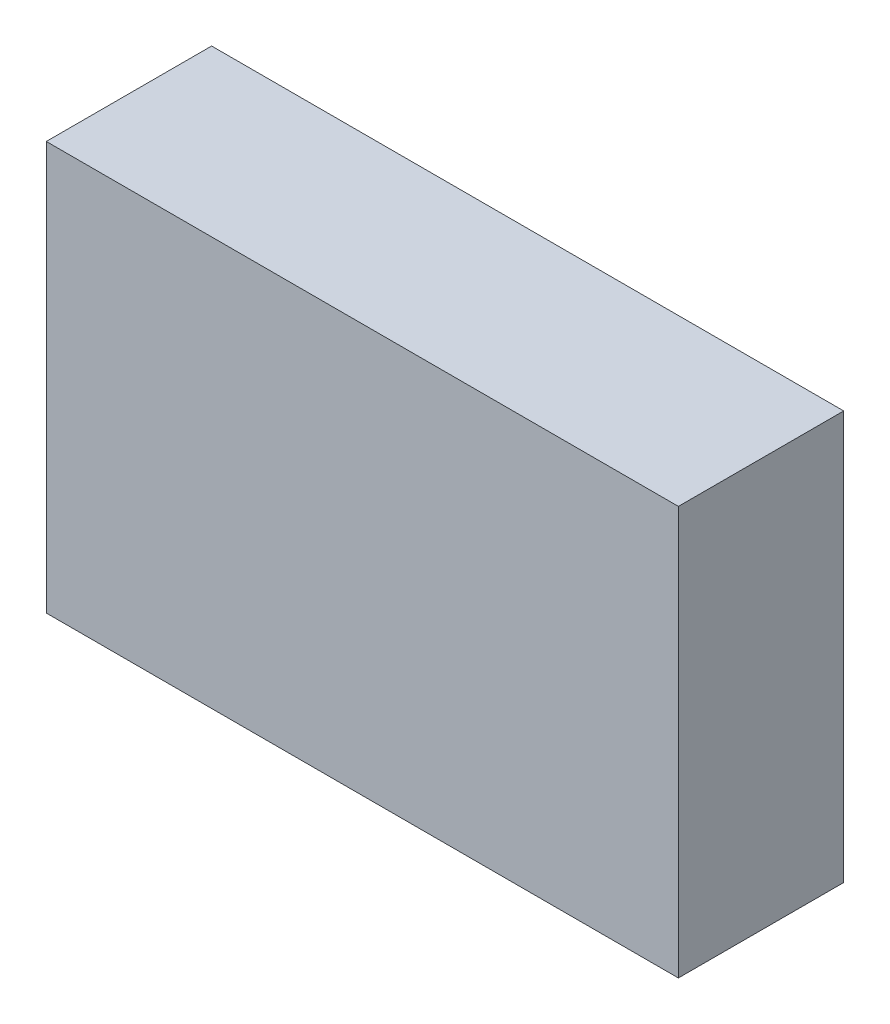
ISO-10303-21;
HEADER;
FILE_DESCRIPTION(('STEP AP214'),'2;1');
FILE_NAME('part.step','',(''),(''),'','','');
FILE_SCHEMA(('AUTOMOTIVE_DESIGN { 1 0 10303 214 1 1 1 1 }'));
ENDSEC;
DATA;
#1=APPLICATION_CONTEXT('core data for automotive mechanical design processes');
#2=APPLICATION_PROTOCOL_DEFINITION('international standard','automotive_design',2000,#1);
#3=PRODUCT_CONTEXT('',#1,'mechanical');
#4=PRODUCT('Part','Part','',(#3));
#5=PRODUCT_RELATED_PRODUCT_CATEGORY('part','',(#4));
#6=PRODUCT_DEFINITION_FORMATION('','',#4);
#7=PRODUCT_DEFINITION_CONTEXT('part definition',#1,'design');
#8=PRODUCT_DEFINITION('design','',#6,#7);
#9=PRODUCT_DEFINITION_SHAPE('','',#8);
#10=(LENGTH_UNIT() NAMED_UNIT(*) SI_UNIT(.MILLI.,.METRE.));
#11=(NAMED_UNIT(*) PLANE_ANGLE_UNIT() SI_UNIT($,.RADIAN.));
#12=(NAMED_UNIT(*) SI_UNIT($,.STERADIAN.) SOLID_ANGLE_UNIT());
#13=UNCERTAINTY_MEASURE_WITH_UNIT(LENGTH_MEASURE(1.E-05),#10,'distance_accuracy_value','');
#14=(GEOMETRIC_REPRESENTATION_CONTEXT(3) GLOBAL_UNCERTAINTY_ASSIGNED_CONTEXT((#13)) GLOBAL_UNIT_ASSIGNED_CONTEXT((#10,
#11,#12)) REPRESENTATION_CONTEXT('',''));
#15=CARTESIAN_POINT('',(0.,0.,0.));
#16=DIRECTION('',(0.,0.,1.));
#17=DIRECTION('',(1.,0.,0.));
#18=AXIS2_PLACEMENT_3D('',#15,#16,#17);
#19=CARTESIAN_POINT('',(0.,0.,8.5));
#20=DIRECTION('',(0.,0.,1.));
#21=DIRECTION('',(1.,0.,0.));
#22=AXIS2_PLACEMENT_3D('',#19,#20,#21);
#23=PLANE('',#22);
#24=DIRECTION('',(-1.,0.,0.));
#25=VECTOR('',#24,1.);
#26=CARTESIAN_POINT('',(0.,-21.,8.5));
#27=LINE('',#26,#25);
#28=CARTESIAN_POINT('',(32.5,-21.,8.5));
#29=VERTEX_POINT('',#28);
#30=CARTESIAN_POINT('',(-32.5,-21.,8.5));
#31=VERTEX_POINT('',#30);
#32=EDGE_CURVE('E11',#29,#31,#27,.T.);
#33=ORIENTED_EDGE('',*,*,#32,.F.);
#34=DIRECTION('',(0.,-1.,0.));
#35=VECTOR('',#34,1.);
#36=CARTESIAN_POINT('',(32.5,0.,8.5));
#37=LINE('',#36,#35);
#38=CARTESIAN_POINT('',(32.5,21.,8.5));
#39=VERTEX_POINT('',#38);
#40=EDGE_CURVE('E61',#39,#29,#37,.T.);
#41=ORIENTED_EDGE('',*,*,#40,.F.);
#42=DIRECTION('',(1.,0.,0.));
#43=VECTOR('',#42,1.);
#44=CARTESIAN_POINT('',(0.,21.,8.5));
#45=LINE('',#44,#43);
#46=CARTESIAN_POINT('',(-32.5,21.,8.5));
#47=VERTEX_POINT('',#46);
#48=EDGE_CURVE('E87',#47,#39,#45,.T.);
#49=ORIENTED_EDGE('',*,*,#48,.F.);
#50=DIRECTION('',(0.,1.,0.));
#51=VECTOR('',#50,1.);
#52=CARTESIAN_POINT('',(-32.5,0.,8.5));
#53=LINE('',#52,#51);
#54=EDGE_CURVE('E24',#31,#47,#53,.T.);
#55=ORIENTED_EDGE('',*,*,#54,.F.);
#56=EDGE_LOOP('',(#33,#41,#49,#55));
#57=FACE_BOUND('',#56,.T.);
#58=ADVANCED_FACE('F17',(#57),#23,.T.);
#59=CARTESIAN_POINT('',(0.,-21.,-8.5));
#60=DIRECTION('',(0.,-1.,0.));
#61=DIRECTION('',(0.,0.,-1.));
#62=AXIS2_PLACEMENT_3D('',#59,#60,#61);
#63=PLANE('',#62);
#64=DIRECTION('',(0.,0.,1.));
#65=VECTOR('',#64,1.);
#66=CARTESIAN_POINT('',(32.5,-21.,-8.5));
#67=LINE('',#66,#65);
#68=CARTESIAN_POINT('',(32.5,-21.,-8.5));
#69=VERTEX_POINT('',#68);
#70=EDGE_CURVE('E53',#69,#29,#67,.T.);
#71=ORIENTED_EDGE('',*,*,#70,.T.);
#72=ORIENTED_EDGE('',*,*,#32,.T.);
#73=DIRECTION('',(0.,0.,1.));
#74=VECTOR('',#73,1.);
#75=CARTESIAN_POINT('',(-32.5,-21.,-8.5));
#76=LINE('',#75,#74);
#77=CARTESIAN_POINT('',(-32.5,-21.,-8.5));
#78=VERTEX_POINT('',#77);
#79=EDGE_CURVE('E70',#78,#31,#76,.T.);
#80=ORIENTED_EDGE('',*,*,#79,.F.);
#81=DIRECTION('',(1.,0.,0.));
#82=VECTOR('',#81,1.);
#83=CARTESIAN_POINT('',(0.,-21.,-8.5));
#84=LINE('',#83,#82);
#85=EDGE_CURVE('E65',#78,#69,#84,.T.);
#86=ORIENTED_EDGE('',*,*,#85,.T.);
#87=EDGE_LOOP('',(#71,#72,#80,#86));
#88=FACE_BOUND('',#87,.T.);
#89=ADVANCED_FACE('F66',(#88),#63,.T.);
#90=CARTESIAN_POINT('',(-32.5,0.,-8.5));
#91=DIRECTION('',(-1.,0.,0.));
#92=DIRECTION('',(0.,0.,1.));
#93=AXIS2_PLACEMENT_3D('',#90,#91,#92);
#94=PLANE('',#93);
#95=ORIENTED_EDGE('',*,*,#79,.T.);
#96=ORIENTED_EDGE('',*,*,#54,.T.);
#97=DIRECTION('',(0.,0.,1.));
#98=VECTOR('',#97,1.);
#99=CARTESIAN_POINT('',(-32.5,21.,-8.5));
#100=LINE('',#99,#98);
#101=CARTESIAN_POINT('',(-32.5,21.,-8.5));
#102=VERTEX_POINT('',#101);
#103=EDGE_CURVE('E85',#102,#47,#100,.T.);
#104=ORIENTED_EDGE('',*,*,#103,.F.);
#105=DIRECTION('',(0.,-1.,0.));
#106=VECTOR('',#105,1.);
#107=CARTESIAN_POINT('',(-32.5,0.,-8.5));
#108=LINE('',#107,#106);
#109=EDGE_CURVE('E75',#102,#78,#108,.T.);
#110=ORIENTED_EDGE('',*,*,#109,.T.);
#111=EDGE_LOOP('',(#95,#96,#104,#110));
#112=FACE_BOUND('',#111,.T.);
#113=ADVANCED_FACE('F93',(#112),#94,.T.);
#114=CARTESIAN_POINT('',(0.,21.,-8.5));
#115=DIRECTION('',(0.,1.,0.));
#116=DIRECTION('',(0.,0.,1.));
#117=AXIS2_PLACEMENT_3D('',#114,#115,#116);
#118=PLANE('',#117);
#119=ORIENTED_EDGE('',*,*,#103,.T.);
#120=ORIENTED_EDGE('',*,*,#48,.T.);
#121=DIRECTION('',(0.,0.,1.));
#122=VECTOR('',#121,1.);
#123=CARTESIAN_POINT('',(32.5,21.,-8.5));
#124=LINE('',#123,#122);
#125=CARTESIAN_POINT('',(32.5,21.,-8.5));
#126=VERTEX_POINT('',#125);
#127=EDGE_CURVE('E62',#126,#39,#124,.T.);
#128=ORIENTED_EDGE('',*,*,#127,.F.);
#129=DIRECTION('',(-1.,0.,0.));
#130=VECTOR('',#129,1.);
#131=CARTESIAN_POINT('',(0.,21.,-8.5));
#132=LINE('',#131,#130);
#133=EDGE_CURVE('E76',#126,#102,#132,.T.);
#134=ORIENTED_EDGE('',*,*,#133,.T.);
#135=EDGE_LOOP('',(#119,#120,#128,#134));
#136=FACE_BOUND('',#135,.T.);
#137=ADVANCED_FACE('F90',(#136),#118,.T.);
#138=CARTESIAN_POINT('',(0.,0.,-8.5));
#139=DIRECTION('',(0.,0.,-1.));
#140=DIRECTION('',(-1.,0.,0.));
#141=AXIS2_PLACEMENT_3D('',#138,#139,#140);
#142=PLANE('',#141);
#143=DIRECTION('',(0.,1.,0.));
#144=VECTOR('',#143,1.);
#145=CARTESIAN_POINT('',(32.5,0.,-8.5));
#146=LINE('',#145,#144);
#147=EDGE_CURVE('E56',#69,#126,#146,.T.);
#148=ORIENTED_EDGE('',*,*,#147,.F.);
#149=ORIENTED_EDGE('',*,*,#85,.F.);
#150=ORIENTED_EDGE('',*,*,#109,.F.);
#151=ORIENTED_EDGE('',*,*,#133,.F.);
#152=EDGE_LOOP('',(#148,#149,#150,#151));
#153=FACE_BOUND('',#152,.T.);
#154=ADVANCED_FACE('F72',(#153),#142,.T.);
#155=CARTESIAN_POINT('',(32.5,0.,-8.5));
#156=DIRECTION('',(1.,0.,0.));
#157=DIRECTION('',(0.,0.,-1.));
#158=AXIS2_PLACEMENT_3D('',#155,#156,#157);
#159=PLANE('',#158);
#160=ORIENTED_EDGE('',*,*,#147,.T.);
#161=ORIENTED_EDGE('',*,*,#127,.T.);
#162=ORIENTED_EDGE('',*,*,#40,.T.);
#163=ORIENTED_EDGE('',*,*,#70,.F.);
#164=EDGE_LOOP('',(#160,#161,#162,#163));
#165=FACE_BOUND('',#164,.T.);
#166=ADVANCED_FACE('F57',(#165),#159,.T.);
#167=CLOSED_SHELL('',(#58,#89,#113,#137,#154,#166));
#168=MANIFOLD_SOLID_BREP('B1',#167);
#169=ADVANCED_BREP_SHAPE_REPRESENTATION('',(#18,#168),#14);
#170=SHAPE_DEFINITION_REPRESENTATION(#9,#169);
ENDSEC;
END-ISO-10303-21;
